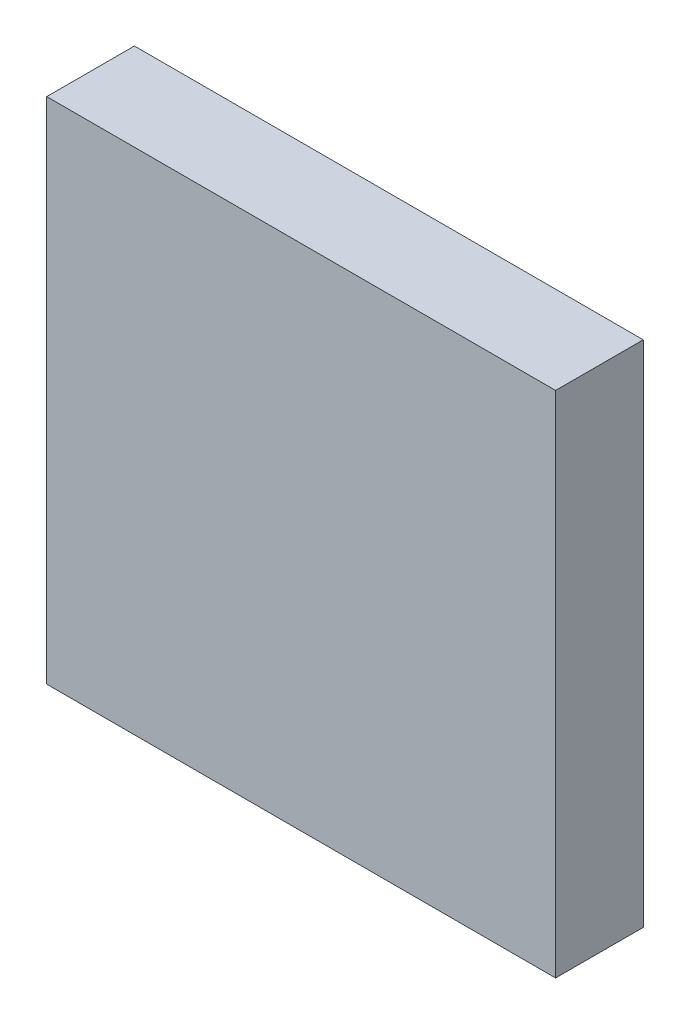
ISO-10303-21;
HEADER;
FILE_DESCRIPTION(('STEP AP214'),'2;1');
FILE_NAME('part.step','',(''),(''),'','','');
FILE_SCHEMA(('AUTOMOTIVE_DESIGN { 1 0 10303 214 1 1 1 1 }'));
ENDSEC;
DATA;
#1=APPLICATION_CONTEXT('core data for automotive mechanical design processes');
#2=APPLICATION_PROTOCOL_DEFINITION('international standard','automotive_design',2000,#1);
#3=PRODUCT_CONTEXT('',#1,'mechanical');
#4=PRODUCT('Part','Part','',(#3));
#5=PRODUCT_RELATED_PRODUCT_CATEGORY('part','',(#4));
#6=PRODUCT_DEFINITION_FORMATION('','',#4);
#7=PRODUCT_DEFINITION_CONTEXT('part definition',#1,'design');
#8=PRODUCT_DEFINITION('design','',#6,#7);
#9=PRODUCT_DEFINITION_SHAPE('','',#8);
#10=(LENGTH_UNIT() NAMED_UNIT(*) SI_UNIT(.MILLI.,.METRE.));
#11=(NAMED_UNIT(*) PLANE_ANGLE_UNIT() SI_UNIT($,.RADIAN.));
#12=(NAMED_UNIT(*) SI_UNIT($,.STERADIAN.) SOLID_ANGLE_UNIT());
#13=UNCERTAINTY_MEASURE_WITH_UNIT(LENGTH_MEASURE(1.E-05),#10,'distance_accuracy_value','');
#14=(GEOMETRIC_REPRESENTATION_CONTEXT(3) GLOBAL_UNCERTAINTY_ASSIGNED_CONTEXT((#13)) GLOBAL_UNIT_ASSIGNED_CONTEXT((#10,
#11,#12)) REPRESENTATION_CONTEXT('',''));
#15=CARTESIAN_POINT('',(0.,0.,0.));
#16=DIRECTION('',(0.,0.,1.));
#17=DIRECTION('',(1.,0.,0.));
#18=AXIS2_PLACEMENT_3D('',#15,#16,#17);
#19=CARTESIAN_POINT('',(6.350001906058E-07,1.587499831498E-06,0.70000114));
#20=DIRECTION('',(0.,0.,-1.));
#21=DIRECTION('',(0.,-1.,0.));
#22=AXIS2_PLACEMENT_3D('',#19,#20,#21);
#23=PLANE('',#22);
#24=DIRECTION('',(1.,0.,0.));
#25=VECTOR('',#24,1.);
#26=CARTESIAN_POINT('',(-2.032,2.032,0.70000114));
#27=LINE('',#26,#25);
#28=CARTESIAN_POINT('',(-2.032,2.032,0.70000114));
#29=VERTEX_POINT('',#28);
#30=CARTESIAN_POINT('',(2.03200254,2.032,0.70000114));
#31=VERTEX_POINT('',#30);
#32=EDGE_CURVE('E25',#29,#31,#27,.T.);
#33=ORIENTED_EDGE('',*,*,#32,.F.);
#34=DIRECTION('',(0.,1.,0.));
#35=VECTOR('',#34,1.);
#36=CARTESIAN_POINT('',(-2.032,-2.03199746,0.70000114));
#37=LINE('',#36,#35);
#38=CARTESIAN_POINT('',(-2.032,-2.03199746,0.70000114));
#39=VERTEX_POINT('',#38);
#40=EDGE_CURVE('E66',#39,#29,#37,.T.);
#41=ORIENTED_EDGE('',*,*,#40,.F.);
#42=DIRECTION('',(-1.,0.,0.));
#43=VECTOR('',#42,1.);
#44=CARTESIAN_POINT('',(2.032,-2.03199746,0.70000114));
#45=LINE('',#44,#43);
#46=CARTESIAN_POINT('',(2.032,-2.03199746,0.70000114));
#47=VERTEX_POINT('',#46);
#48=EDGE_CURVE('E69',#47,#39,#45,.T.);
#49=ORIENTED_EDGE('',*,*,#48,.F.);
#50=DIRECTION('',(-6.25000382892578E-07,-0.999999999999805,0.));
#51=VECTOR('',#50,1.);
#52=CARTESIAN_POINT('',(2.03200254,2.032,0.70000114));
#53=LINE('',#52,#51);
#54=EDGE_CURVE('E101',#31,#47,#53,.T.);
#55=ORIENTED_EDGE('',*,*,#54,.F.);
#56=EDGE_LOOP('',(#33,#41,#49,#55));
#57=FACE_BOUND('',#56,.T.);
#58=ADVANCED_FACE('F17',(#57),#23,.F.);
#59=CARTESIAN_POINT('',(6.350001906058E-07,1.587499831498E-06,0.));
#60=DIRECTION('',(0.,0.,-1.));
#61=DIRECTION('',(0.,-1.,0.));
#62=AXIS2_PLACEMENT_3D('',#59,#60,#61);
#63=PLANE('',#62);
#64=DIRECTION('',(-6.25000382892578E-07,-0.999999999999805,0.));
#65=VECTOR('',#64,1.);
#66=CARTESIAN_POINT('',(2.03200254,2.032,0.));
#67=LINE('',#66,#65);
#68=CARTESIAN_POINT('',(2.03200254,2.032,0.));
#69=VERTEX_POINT('',#68);
#70=CARTESIAN_POINT('',(2.032,-2.03199746,0.));
#71=VERTEX_POINT('',#70);
#72=EDGE_CURVE('E90',#69,#71,#67,.T.);
#73=ORIENTED_EDGE('',*,*,#72,.T.);
#74=DIRECTION('',(-1.,0.,0.));
#75=VECTOR('',#74,1.);
#76=CARTESIAN_POINT('',(2.032,-2.03199746,0.));
#77=LINE('',#76,#75);
#78=CARTESIAN_POINT('',(-2.032,-2.03199746,0.));
#79=VERTEX_POINT('',#78);
#80=EDGE_CURVE('E75',#71,#79,#77,.T.);
#81=ORIENTED_EDGE('',*,*,#80,.T.);
#82=DIRECTION('',(0.,1.,0.));
#83=VECTOR('',#82,1.);
#84=CARTESIAN_POINT('',(-2.032,-2.03199746,0.));
#85=LINE('',#84,#83);
#86=CARTESIAN_POINT('',(-2.032,2.032,0.));
#87=VERTEX_POINT('',#86);
#88=EDGE_CURVE('E80',#79,#87,#85,.T.);
#89=ORIENTED_EDGE('',*,*,#88,.T.);
#90=DIRECTION('',(1.,0.,0.));
#91=VECTOR('',#90,1.);
#92=CARTESIAN_POINT('',(-2.032,2.032,0.));
#93=LINE('',#92,#91);
#94=EDGE_CURVE('E11',#87,#69,#93,.T.);
#95=ORIENTED_EDGE('',*,*,#94,.T.);
#96=EDGE_LOOP('',(#73,#81,#89,#95));
#97=FACE_BOUND('',#96,.T.);
#98=ADVANCED_FACE('F115',(#97),#63,.T.);
#99=CARTESIAN_POINT('',(-2.032,2.032,0.));
#100=DIRECTION('',(0.,1.,0.));
#101=DIRECTION('',(1.,0.,0.));
#102=AXIS2_PLACEMENT_3D('',#99,#100,#101);
#103=PLANE('',#102);
#104=DIRECTION('',(0.,0.,1.));
#105=VECTOR('',#104,1.);
#106=CARTESIAN_POINT('',(-2.032,2.032,0.));
#107=LINE('',#106,#105);
#108=EDGE_CURVE('E74',#87,#29,#107,.T.);
#109=ORIENTED_EDGE('',*,*,#108,.T.);
#110=ORIENTED_EDGE('',*,*,#32,.T.);
#111=DIRECTION('',(0.,0.,1.));
#112=VECTOR('',#111,1.);
#113=CARTESIAN_POINT('',(2.03200254,2.032,0.));
#114=LINE('',#113,#112);
#115=EDGE_CURVE('E100',#69,#31,#114,.T.);
#116=ORIENTED_EDGE('',*,*,#115,.F.);
#117=ORIENTED_EDGE('',*,*,#94,.F.);
#118=EDGE_LOOP('',(#109,#110,#116,#117));
#119=FACE_BOUND('',#118,.T.);
#120=ADVANCED_FACE('F117',(#119),#103,.T.);
#121=CARTESIAN_POINT('',(-2.032,-2.03199746,0.));
#122=DIRECTION('',(-1.,0.,0.));
#123=DIRECTION('',(0.,0.,1.));
#124=AXIS2_PLACEMENT_3D('',#121,#122,#123);
#125=PLANE('',#124);
#126=DIRECTION('',(0.,0.,1.));
#127=VECTOR('',#126,1.);
#128=CARTESIAN_POINT('',(-2.032,-2.03199746,0.));
#129=LINE('',#128,#127);
#130=EDGE_CURVE('E78',#79,#39,#129,.T.);
#131=ORIENTED_EDGE('',*,*,#130,.T.);
#132=ORIENTED_EDGE('',*,*,#40,.T.);
#133=ORIENTED_EDGE('',*,*,#108,.F.);
#134=ORIENTED_EDGE('',*,*,#88,.F.);
#135=EDGE_LOOP('',(#131,#132,#133,#134));
#136=FACE_BOUND('',#135,.T.);
#137=ADVANCED_FACE('F79',(#136),#125,.T.);
#138=CARTESIAN_POINT('',(2.032,-2.03199746,0.));
#139=DIRECTION('',(0.,-1.,0.));
#140=DIRECTION('',(0.,0.,-1.));
#141=AXIS2_PLACEMENT_3D('',#138,#139,#140);
#142=PLANE('',#141);
#143=DIRECTION('',(0.,0.,1.));
#144=VECTOR('',#143,1.);
#145=CARTESIAN_POINT('',(2.032,-2.03199746,0.));
#146=LINE('',#145,#144);
#147=EDGE_CURVE('E87',#71,#47,#146,.T.);
#148=ORIENTED_EDGE('',*,*,#147,.T.);
#149=ORIENTED_EDGE('',*,*,#48,.T.);
#150=ORIENTED_EDGE('',*,*,#130,.F.);
#151=ORIENTED_EDGE('',*,*,#80,.F.);
#152=EDGE_LOOP('',(#148,#149,#150,#151));
#153=FACE_BOUND('',#152,.T.);
#154=ADVANCED_FACE('F85',(#153),#142,.T.);
#155=CARTESIAN_POINT('',(2.03200254,2.032,0.));
#156=DIRECTION('',(0.999999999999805,-6.25000382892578E-07,0.));
#157=DIRECTION('',(0.,0.,-1.));
#158=AXIS2_PLACEMENT_3D('',#155,#156,#157);
#159=PLANE('',#158);
#160=ORIENTED_EDGE('',*,*,#115,.T.);
#161=ORIENTED_EDGE('',*,*,#54,.T.);
#162=ORIENTED_EDGE('',*,*,#147,.F.);
#163=ORIENTED_EDGE('',*,*,#72,.F.);
#164=EDGE_LOOP('',(#160,#161,#162,#163));
#165=FACE_BOUND('',#164,.T.);
#166=ADVANCED_FACE('F120',(#165),#159,.T.);
#167=CLOSED_SHELL('',(#58,#98,#120,#137,#154,#166));
#168=MANIFOLD_SOLID_BREP('B1',#167);
#169=ADVANCED_BREP_SHAPE_REPRESENTATION('',(#18,#168),#14);
#170=SHAPE_DEFINITION_REPRESENTATION(#9,#169);
ENDSEC;
END-ISO-10303-21;
